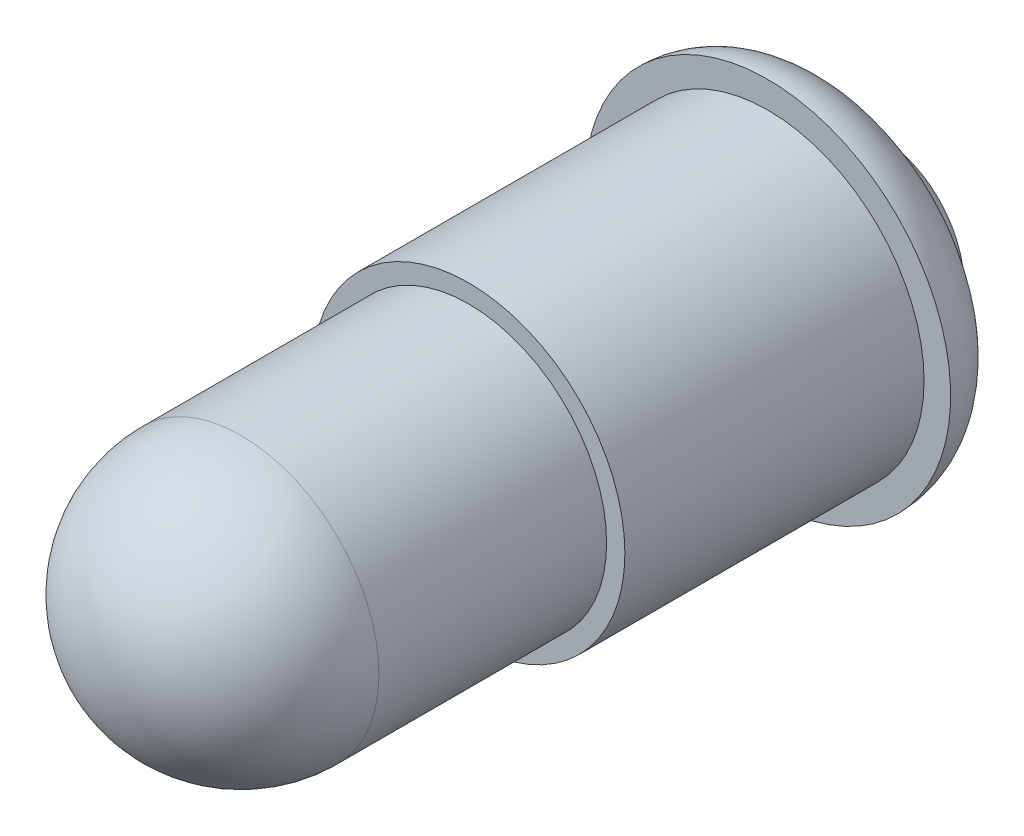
ISO-10303-21;
HEADER;
FILE_DESCRIPTION(('STEP AP214'),'2;1');
FILE_NAME('part.step','',(''),(''),'','','');
FILE_SCHEMA(('AUTOMOTIVE_DESIGN { 1 0 10303 214 1 1 1 1 }'));
ENDSEC;
DATA;
#1=APPLICATION_CONTEXT('core data for automotive mechanical design processes');
#2=APPLICATION_PROTOCOL_DEFINITION('international standard','automotive_design',2000,#1);
#3=PRODUCT_CONTEXT('',#1,'mechanical');
#4=PRODUCT('Part','Part','',(#3));
#5=PRODUCT_RELATED_PRODUCT_CATEGORY('part','',(#4));
#6=PRODUCT_DEFINITION_FORMATION('','',#4);
#7=PRODUCT_DEFINITION_CONTEXT('part definition',#1,'design');
#8=PRODUCT_DEFINITION('design','',#6,#7);
#9=PRODUCT_DEFINITION_SHAPE('','',#8);
#10=(LENGTH_UNIT() NAMED_UNIT(*) SI_UNIT(.MILLI.,.METRE.));
#11=(NAMED_UNIT(*) PLANE_ANGLE_UNIT() SI_UNIT($,.RADIAN.));
#12=(NAMED_UNIT(*) SI_UNIT($,.STERADIAN.) SOLID_ANGLE_UNIT());
#13=UNCERTAINTY_MEASURE_WITH_UNIT(LENGTH_MEASURE(1.E-05),#10,'distance_accuracy_value','');
#14=(GEOMETRIC_REPRESENTATION_CONTEXT(3) GLOBAL_UNCERTAINTY_ASSIGNED_CONTEXT((#13)) GLOBAL_UNIT_ASSIGNED_CONTEXT((#10,
#11,#12)) REPRESENTATION_CONTEXT('',''));
#15=CARTESIAN_POINT('',(0.,0.,0.));
#16=DIRECTION('',(0.,0.,1.));
#17=DIRECTION('',(1.,0.,0.));
#18=AXIS2_PLACEMENT_3D('',#15,#16,#17);
#19=CARTESIAN_POINT('',(0.,0.,4.5));
#20=DIRECTION('',(0.,0.,1.));
#21=DIRECTION('',(1.,0.,0.));
#22=AXIS2_PLACEMENT_3D('',#19,#20,#21);
#23=PLANE('',#22);
#24=CARTESIAN_POINT('',(0.,0.,4.5));
#25=DIRECTION('',(0.,0.,1.));
#26=DIRECTION('',(1.,0.,0.));
#27=AXIS2_PLACEMENT_3D('',#24,#25,#26);
#28=CIRCLE('',#27,2.35);
#29=CARTESIAN_POINT('',(2.35,0.,4.5));
#30=VERTEX_POINT('',#29);
#31=EDGE_CURVE('E69',#30,#30,#28,.T.);
#32=ORIENTED_EDGE('',*,*,#31,.T.);
#33=EDGE_LOOP('',(#32));
#34=FACE_BOUND('',#33,.T.);
#35=CARTESIAN_POINT('',(0.,0.,4.5));
#36=DIRECTION('',(0.,0.,1.));
#37=DIRECTION('',(1.,0.,0.));
#38=AXIS2_PLACEMENT_3D('',#35,#36,#37);
#39=CIRCLE('',#38,2.075);
#40=CARTESIAN_POINT('',(2.075,0.,4.5));
#41=VERTEX_POINT('',#40);
#42=EDGE_CURVE('E66',#41,#41,#39,.T.);
#43=ORIENTED_EDGE('',*,*,#42,.F.);
#44=EDGE_LOOP('',(#43));
#45=FACE_BOUND('',#44,.T.);
#46=ADVANCED_FACE('F27',(#34,#45),#23,.T.);
#47=CARTESIAN_POINT('',(0.,0.,4.5));
#48=DIRECTION('',(0.,0.,-1.));
#49=DIRECTION('',(-1.,0.,0.));
#50=AXIS2_PLACEMENT_3D('',#47,#48,#49);
#51=CYLINDRICAL_SURFACE('',#50,2.35);
#52=ORIENTED_EDGE('',*,*,#31,.F.);
#53=EDGE_LOOP('',(#52));
#54=FACE_BOUND('',#53,.T.);
#55=CARTESIAN_POINT('',(0.,0.,0.));
#56=DIRECTION('',(0.,0.,-1.));
#57=DIRECTION('',(-1.,0.,0.));
#58=AXIS2_PLACEMENT_3D('',#55,#56,#57);
#59=CIRCLE('',#58,2.35);
#60=CARTESIAN_POINT('',(-2.35,0.,0.));
#61=VERTEX_POINT('',#60);
#62=EDGE_CURVE('E61',#61,#61,#59,.T.);
#63=ORIENTED_EDGE('',*,*,#62,.F.);
#64=EDGE_LOOP('',(#63));
#65=FACE_BOUND('',#64,.T.);
#66=ADVANCED_FACE('F29',(#54,#65),#51,.T.);
#67=CARTESIAN_POINT('',(0.,0.,10.));
#68=DIRECTION('',(0.,0.,-1.));
#69=DIRECTION('',(-1.,0.,0.));
#70=AXIS2_PLACEMENT_3D('',#67,#68,#69);
#71=CYLINDRICAL_SURFACE('',#70,2.075);
#72=CARTESIAN_POINT('',(0.,0.,7.925));
#73=DIRECTION('',(0.,0.,-1.));
#74=DIRECTION('',(-1.,0.,0.));
#75=AXIS2_PLACEMENT_3D('',#72,#73,#74);
#76=CIRCLE('',#75,2.075);
#77=CARTESIAN_POINT('',(-2.075,0.,7.925));
#78=VERTEX_POINT('',#77);
#79=EDGE_CURVE('E72',#78,#78,#76,.T.);
#80=ORIENTED_EDGE('',*,*,#79,.T.);
#81=EDGE_LOOP('',(#80));
#82=FACE_BOUND('',#81,.T.);
#83=ORIENTED_EDGE('',*,*,#42,.T.);
#84=EDGE_LOOP('',(#83));
#85=FACE_BOUND('',#84,.T.);
#86=ADVANCED_FACE('F97',(#82,#85),#71,.T.);
#87=CARTESIAN_POINT('',(0.,0.,7.925));
#88=DIRECTION('',(0.,0.,1.));
#89=DIRECTION('',(1.,0.,0.));
#90=AXIS2_PLACEMENT_3D('',#87,#88,#89);
#91=SPHERICAL_SURFACE('',#90,2.075);
#92=ORIENTED_EDGE('',*,*,#79,.F.);
#93=EDGE_LOOP('',(#92));
#94=FACE_BOUND('',#93,.T.);
#95=ADVANCED_FACE('F89',(#94),#91,.T.);
#96=CARTESIAN_POINT('',(0.,0.,0.));
#97=DIRECTION('',(0.,0.,-1.));
#98=DIRECTION('',(-1.,0.,0.));
#99=AXIS2_PLACEMENT_3D('',#96,#97,#98);
#100=PLANE('',#99);
#101=CARTESIAN_POINT('',(0.,0.,0.));
#102=DIRECTION('',(0.,0.,-1.));
#103=DIRECTION('',(-1.,0.,0.));
#104=AXIS2_PLACEMENT_3D('',#101,#102,#103);
#105=CIRCLE('',#104,2.75);
#106=CARTESIAN_POINT('',(-2.75,0.,0.));
#107=VERTEX_POINT('',#106);
#108=EDGE_CURVE('E59',#107,#107,#105,.T.);
#109=ORIENTED_EDGE('',*,*,#108,.F.);
#110=EDGE_LOOP('',(#109));
#111=FACE_BOUND('',#110,.T.);
#112=ORIENTED_EDGE('',*,*,#62,.T.);
#113=EDGE_LOOP('',(#112));
#114=FACE_BOUND('',#113,.T.);
#115=ADVANCED_FACE('F81',(#111,#114),#100,.F.);
#116=CARTESIAN_POINT('',(0.,0.,0.));
#117=DIRECTION('',(0.,0.,-1.));
#118=DIRECTION('',(-1.,0.,0.));
#119=AXIS2_PLACEMENT_3D('',#116,#117,#118);
#120=TOROIDAL_SURFACE('',#119,1.75,1.);
#121=ORIENTED_EDGE('',*,*,#108,.T.);
#122=EDGE_LOOP('',(#121));
#123=FACE_BOUND('',#122,.T.);
#124=CARTESIAN_POINT('',(0.,0.,-0.999999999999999));
#125=DIRECTION('',(0.,0.,-1.));
#126=DIRECTION('',(-1.,0.,0.));
#127=AXIS2_PLACEMENT_3D('',#124,#125,#126);
#128=CIRCLE('',#127,1.75);
#129=CARTESIAN_POINT('',(-1.75,0.,-0.999999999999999));
#130=VERTEX_POINT('',#129);
#131=EDGE_CURVE('E54',#130,#130,#128,.T.);
#132=ORIENTED_EDGE('',*,*,#131,.F.);
#133=EDGE_LOOP('',(#132));
#134=FACE_BOUND('',#133,.T.);
#135=ADVANCED_FACE('F79',(#123,#134),#120,.T.);
#136=CARTESIAN_POINT('',(0.,0.,-1.25));
#137=DIRECTION('',(0.,0.,-1.));
#138=DIRECTION('',(-1.,0.,0.));
#139=AXIS2_PLACEMENT_3D('',#136,#137,#138);
#140=PLANE('',#139);
#141=CARTESIAN_POINT('',(0.,-0.092903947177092,-1.25));
#142=DIRECTION('',(0.,0.,-1.));
#143=DIRECTION('',(-1.,0.,0.));
#144=AXIS2_PLACEMENT_3D('',#141,#142,#143);
#145=CIRCLE('',#144,1.5);
#146=CARTESIAN_POINT('',(-1.49928056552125,-0.0464519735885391,-1.25));
#147=VERTEX_POINT('',#146);
#148=CARTESIAN_POINT('',(1.49928056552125,-0.0464519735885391,-1.25));
#149=VERTEX_POINT('',#148);
#150=EDGE_CURVE('E53',#147,#149,#145,.T.);
#151=ORIENTED_EDGE('',*,*,#150,.F.);
#152=CARTESIAN_POINT('',(0.,0.,-1.25));
#153=DIRECTION('',(0.,0.,-1.));
#154=DIRECTION('',(-1.,0.,0.));
#155=AXIS2_PLACEMENT_3D('',#152,#153,#154);
#156=CIRCLE('',#155,1.5);
#157=EDGE_CURVE('E49',#147,#149,#156,.T.);
#158=ORIENTED_EDGE('',*,*,#157,.T.);
#159=EDGE_LOOP('',(#151,#158));
#160=FACE_BOUND('',#159,.T.);
#161=ADVANCED_FACE('F52',(#160),#140,.T.);
#162=CARTESIAN_POINT('',(0.,0.,-1.25));
#163=DIRECTION('',(0.,0.,1.));
#164=DIRECTION('',(1.,0.,0.));
#165=AXIS2_PLACEMENT_3D('',#162,#163,#164);
#166=CONICAL_SURFACE('',#165,1.5,0.785398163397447);
#167=ORIENTED_EDGE('',*,*,#131,.T.);
#168=EDGE_LOOP('',(#167));
#169=FACE_BOUND('',#168,.T.);
#170=EDGE_CURVE('E35',#149,#147,#156,.T.);
#171=ORIENTED_EDGE('',*,*,#170,.F.);
#172=ORIENTED_EDGE('',*,*,#157,.F.);
#173=EDGE_LOOP('',(#171,#172));
#174=FACE_BOUND('',#173,.T.);
#175=ADVANCED_FACE('F48',(#169,#174),#166,.T.);
#176=CARTESIAN_POINT('',(0.,-0.092903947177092,-1.25));
#177=DIRECTION('',(0.,0.,-1.));
#178=DIRECTION('',(-1.,0.,0.));
#179=AXIS2_PLACEMENT_3D('',#176,#177,#178);
#180=PLANE('',#179);
#181=EDGE_CURVE('E41',#149,#147,#145,.T.);
#182=ORIENTED_EDGE('',*,*,#181,.F.);
#183=ORIENTED_EDGE('',*,*,#170,.T.);
#184=EDGE_LOOP('',(#182,#183));
#185=FACE_BOUND('',#184,.T.);
#186=ADVANCED_FACE('F55',(#185),#180,.F.);
#187=CARTESIAN_POINT('',(0.,-0.092903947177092,-1.75));
#188=DIRECTION('',(0.,0.,-1.));
#189=DIRECTION('',(-1.,0.,0.));
#190=AXIS2_PLACEMENT_3D('',#187,#188,#189);
#191=PLANE('',#190);
#192=CARTESIAN_POINT('',(0.,-0.092903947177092,-1.75));
#193=DIRECTION('',(0.,0.,-1.));
#194=DIRECTION('',(-1.,0.,0.));
#195=AXIS2_PLACEMENT_3D('',#192,#193,#194);
#196=CIRCLE('',#195,1.);
#197=CARTESIAN_POINT('',(-1.,-0.092903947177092,-1.75));
#198=VERTEX_POINT('',#197);
#199=EDGE_CURVE('E11',#198,#198,#196,.T.);
#200=ORIENTED_EDGE('',*,*,#199,.T.);
#201=EDGE_LOOP('',(#200));
#202=FACE_BOUND('',#201,.T.);
#203=ADVANCED_FACE('F136',(#202),#191,.T.);
#204=CARTESIAN_POINT('',(0.,-0.092903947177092,-1.25));
#205=DIRECTION('',(0.,0.,-1.));
#206=DIRECTION('',(-1.,0.,0.));
#207=AXIS2_PLACEMENT_3D('',#204,#205,#206);
#208=TOROIDAL_SURFACE('',#207,1.,0.5);
#209=ORIENTED_EDGE('',*,*,#181,.T.);
#210=ORIENTED_EDGE('',*,*,#150,.T.);
#211=EDGE_LOOP('',(#209,#210));
#212=FACE_BOUND('',#211,.T.);
#213=ORIENTED_EDGE('',*,*,#199,.F.);
#214=EDGE_LOOP('',(#213));
#215=FACE_BOUND('',#214,.T.);
#216=ADVANCED_FACE('F57',(#212,#215),#208,.T.);
#217=CLOSED_SHELL('',(#46,#66,#86,#95,#115,#135,#161,#175,#186,#203,#216));
#218=MANIFOLD_SOLID_BREP('B2',#217);
#219=ADVANCED_BREP_SHAPE_REPRESENTATION('',(#18,#218),#14);
#220=SHAPE_DEFINITION_REPRESENTATION(#9,#219);
ENDSEC;
END-ISO-10303-21;
